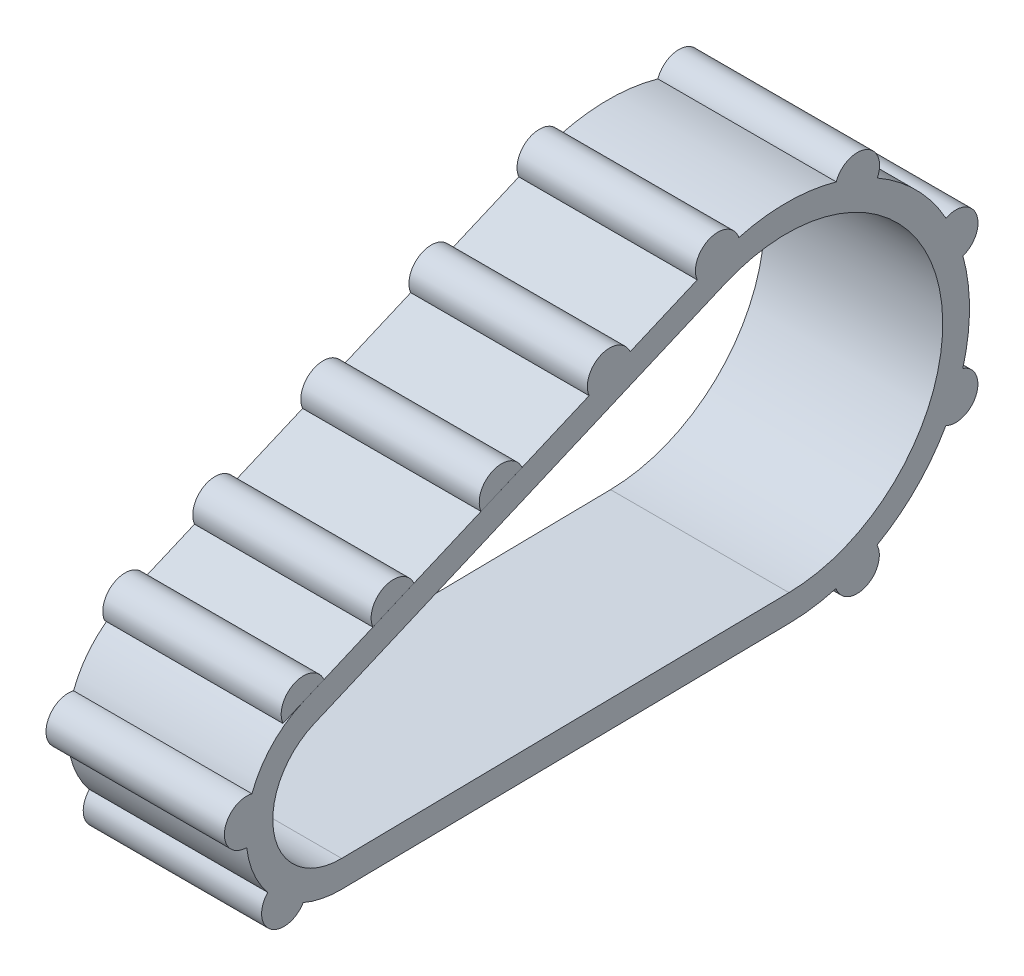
ISO-10303-21;
HEADER;
FILE_DESCRIPTION(('STEP AP214'),'2;1');
FILE_NAME('part.step','',(''),(''),'','','');
FILE_SCHEMA(('AUTOMOTIVE_DESIGN { 1 0 10303 214 1 1 1 1 }'));
ENDSEC;
DATA;
#1=APPLICATION_CONTEXT('core data for automotive mechanical design processes');
#2=APPLICATION_PROTOCOL_DEFINITION('international standard','automotive_design',2000,#1);
#3=PRODUCT_CONTEXT('',#1,'mechanical');
#4=PRODUCT('Part','Part','',(#3));
#5=PRODUCT_RELATED_PRODUCT_CATEGORY('part','',(#4));
#6=PRODUCT_DEFINITION_FORMATION('','',#4);
#7=PRODUCT_DEFINITION_CONTEXT('part definition',#1,'design');
#8=PRODUCT_DEFINITION('design','',#6,#7);
#9=PRODUCT_DEFINITION_SHAPE('','',#8);
#10=(LENGTH_UNIT() NAMED_UNIT(*) SI_UNIT(.MILLI.,.METRE.));
#11=(NAMED_UNIT(*) PLANE_ANGLE_UNIT() SI_UNIT($,.RADIAN.));
#12=(NAMED_UNIT(*) SI_UNIT($,.STERADIAN.) SOLID_ANGLE_UNIT());
#13=UNCERTAINTY_MEASURE_WITH_UNIT(LENGTH_MEASURE(1.E-05),#10,'distance_accuracy_value','');
#14=(GEOMETRIC_REPRESENTATION_CONTEXT(3) GLOBAL_UNCERTAINTY_ASSIGNED_CONTEXT((#13)) GLOBAL_UNIT_ASSIGNED_CONTEXT((#10,
#11,#12)) REPRESENTATION_CONTEXT('',''));
#15=CARTESIAN_POINT('',(0.,0.,0.));
#16=DIRECTION('',(0.,0.,1.));
#17=DIRECTION('',(1.,0.,0.));
#18=AXIS2_PLACEMENT_3D('',#15,#16,#17);
#19=CARTESIAN_POINT('',(0.,-18.1072132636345,69.3764642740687));
#20=DIRECTION('',(0.,0.919535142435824,0.393007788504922));
#21=DIRECTION('',(0.,0.393007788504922,-0.919535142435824));
#22=AXIS2_PLACEMENT_3D('',#19,#20,#21);
#23=PLANE('',#22);
#24=DIRECTION('',(0.,0.393007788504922,-0.919535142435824));
#25=VECTOR('',#24,1.);
#26=CARTESIAN_POINT('',(20.,-18.1072132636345,69.3764642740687));
#27=LINE('',#26,#25);
#28=CARTESIAN_POINT('',(20.,18.2683127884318,-15.7327256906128));
#29=VERTEX_POINT('',#28);
#30=CARTESIAN_POINT('',(20.,20.2333433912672,-20.3303818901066));
#31=VERTEX_POINT('',#30);
#32=EDGE_CURVE('E80',#29,#31,#27,.T.);
#33=ORIENTED_EDGE('',*,*,#32,.F.);
#34=DIRECTION('',(1.,0.,0.));
#35=VECTOR('',#34,1.);
#36=CARTESIAN_POINT('',(0.,18.2683127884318,-15.7327256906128));
#37=LINE('',#36,#35);
#38=CARTESIAN_POINT('',(0.,18.2683127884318,-15.7327256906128));
#39=VERTEX_POINT('',#38);
#40=EDGE_CURVE('E52',#39,#29,#37,.T.);
#41=ORIENTED_EDGE('',*,*,#40,.F.);
#42=DIRECTION('',(0.,0.393007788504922,-0.919535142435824));
#43=VECTOR('',#42,1.);
#44=CARTESIAN_POINT('',(0.,-18.1072132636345,69.3764642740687));
#45=LINE('',#44,#43);
#46=CARTESIAN_POINT('',(0.,20.2333433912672,-20.3303818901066));
#47=VERTEX_POINT('',#46);
#48=EDGE_CURVE('E79',#39,#47,#45,.T.);
#49=ORIENTED_EDGE('',*,*,#48,.T.);
#50=DIRECTION('',(1.,0.,0.));
#51=VECTOR('',#50,1.);
#52=CARTESIAN_POINT('',(0.,20.2333433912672,-20.3303818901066));
#53=LINE('',#52,#51);
#54=EDGE_CURVE('E12',#47,#31,#53,.T.);
#55=ORIENTED_EDGE('',*,*,#54,.T.);
#56=EDGE_LOOP('',(#33,#41,#49,#55));
#57=FACE_BOUND('',#56,.T.);
#58=ADVANCED_FACE('F49',(#57),#23,.F.);
#59=CARTESIAN_POINT('',(0.,19.2489160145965,-18.0323710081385));
#60=DIRECTION('',(1.,0.,0.));
#61=DIRECTION('',(0.,0.,1.));
#62=AXIS2_PLACEMENT_3D('',#59,#60,#61);
#63=CYLINDRICAL_SURFACE('',#62,2.49999025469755);
#64=CARTESIAN_POINT('',(20.,19.2489160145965,-18.0323710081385));
#65=DIRECTION('',(-1.,0.,0.));
#66=DIRECTION('',(0.,0.,1.));
#67=AXIS2_PLACEMENT_3D('',#64,#65,#66);
#68=CIRCLE('',#67,2.49999025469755);
#69=EDGE_CURVE('E72',#29,#31,#68,.T.);
#70=ORIENTED_EDGE('',*,*,#69,.T.);
#71=ORIENTED_EDGE('',*,*,#54,.F.);
#72=CARTESIAN_POINT('',(0.,19.2489160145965,-18.0323710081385));
#73=DIRECTION('',(-1.,0.,0.));
#74=DIRECTION('',(0.,0.,1.));
#75=AXIS2_PLACEMENT_3D('',#72,#73,#74);
#76=CIRCLE('',#75,2.49999025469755);
#77=EDGE_CURVE('E64',#39,#47,#76,.T.);
#78=ORIENTED_EDGE('',*,*,#77,.F.);
#79=ORIENTED_EDGE('',*,*,#40,.T.);
#80=EDGE_LOOP('',(#70,#71,#78,#79));
#81=FACE_BOUND('',#80,.T.);
#82=ADVANCED_FACE('F75',(#81),#63,.T.);
#83=CARTESIAN_POINT('',(0.,1.85458221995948,77.9081024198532));
#84=DIRECTION('',(1.,0.,0.));
#85=DIRECTION('',(0.,0.,1.));
#86=AXIS2_PLACEMENT_3D('',#83,#84,#85);
#87=PLANE('',#86);
#88=ORIENTED_EDGE('',*,*,#48,.F.);
#89=ORIENTED_EDGE('',*,*,#77,.T.);
#90=EDGE_LOOP('',(#88,#89));
#91=FACE_BOUND('',#90,.T.);
#92=ADVANCED_FACE('F88',(#91),#87,.F.);
#93=CARTESIAN_POINT('',(20.,1.85458221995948,77.9081024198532));
#94=DIRECTION('',(1.,0.,0.));
#95=DIRECTION('',(0.,0.,1.));
#96=AXIS2_PLACEMENT_3D('',#93,#94,#95);
#97=PLANE('',#96);
#98=ORIENTED_EDGE('',*,*,#32,.T.);
#99=ORIENTED_EDGE('',*,*,#69,.F.);
#100=EDGE_LOOP('',(#98,#99));
#101=FACE_BOUND('',#100,.T.);
#102=ADVANCED_FACE('F83',(#101),#97,.T.);
#103=CLOSED_SHELL('',(#58,#82,#92,#102));
#104=MANIFOLD_SOLID_BREP('B2',#103);
#105=CARTESIAN_POINT('',(0.,-18.106257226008,69.3768728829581));
#106=DIRECTION('',(0.,0.919535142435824,0.393007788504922));
#107=DIRECTION('',(0.,0.393007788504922,-0.919535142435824));
#108=AXIS2_PLACEMENT_3D('',#105,#106,#107);
#109=PLANE('',#108);
#110=DIRECTION('',(0.,0.393007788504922,-0.919535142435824));
#111=VECTOR('',#110,1.);
#112=CARTESIAN_POINT('',(20.,-18.106257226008,69.3768728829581));
#113=LINE('',#112,#111);
#114=CARTESIAN_POINT('',(20.,13.0891250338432,-3.61213931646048));
#115=VERTEX_POINT('',#114);
#116=CARTESIAN_POINT('',(20.,15.0541556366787,-8.20979551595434));
#117=VERTEX_POINT('',#116);
#118=EDGE_CURVE('E161',#115,#117,#113,.T.);
#119=ORIENTED_EDGE('',*,*,#118,.F.);
#120=DIRECTION('',(1.,0.,0.));
#121=VECTOR('',#120,1.);
#122=CARTESIAN_POINT('',(0.,13.0891250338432,-3.61213931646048));
#123=LINE('',#122,#121);
#124=CARTESIAN_POINT('',(0.,13.0891250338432,-3.61213931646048));
#125=VERTEX_POINT('',#124);
#126=EDGE_CURVE('E133',#125,#115,#123,.T.);
#127=ORIENTED_EDGE('',*,*,#126,.F.);
#128=DIRECTION('',(0.,0.393007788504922,-0.919535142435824));
#129=VECTOR('',#128,1.);
#130=CARTESIAN_POINT('',(0.,-18.106257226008,69.3768728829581));
#131=LINE('',#130,#129);
#132=CARTESIAN_POINT('',(0.,15.0541556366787,-8.20979551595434));
#133=VERTEX_POINT('',#132);
#134=EDGE_CURVE('E160',#125,#133,#131,.T.);
#135=ORIENTED_EDGE('',*,*,#134,.T.);
#136=DIRECTION('',(1.,0.,0.));
#137=VECTOR('',#136,1.);
#138=CARTESIAN_POINT('',(0.,15.0541556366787,-8.20979551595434));
#139=LINE('',#138,#137);
#140=EDGE_CURVE('E47',#133,#117,#139,.T.);
#141=ORIENTED_EDGE('',*,*,#140,.T.);
#142=EDGE_LOOP('',(#119,#127,#135,#141));
#143=FACE_BOUND('',#142,.T.);
#144=ADVANCED_FACE('F130',(#143),#109,.F.);
#145=CARTESIAN_POINT('',(0.,14.0697282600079,-5.91178463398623));
#146=DIRECTION('',(1.,0.,0.));
#147=DIRECTION('',(0.,0.,1.));
#148=AXIS2_PLACEMENT_3D('',#145,#146,#147);
#149=CYLINDRICAL_SURFACE('',#148,2.49999025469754);
#150=CARTESIAN_POINT('',(20.,14.0697282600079,-5.91178463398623));
#151=DIRECTION('',(-1.,0.,0.));
#152=DIRECTION('',(0.,0.,1.));
#153=AXIS2_PLACEMENT_3D('',#150,#151,#152);
#154=CIRCLE('',#153,2.49999025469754);
#155=EDGE_CURVE('E153',#115,#117,#154,.T.);
#156=ORIENTED_EDGE('',*,*,#155,.T.);
#157=ORIENTED_EDGE('',*,*,#140,.F.);
#158=CARTESIAN_POINT('',(0.,14.0697282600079,-5.91178463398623));
#159=DIRECTION('',(-1.,0.,0.));
#160=DIRECTION('',(0.,0.,1.));
#161=AXIS2_PLACEMENT_3D('',#158,#159,#160);
#162=CIRCLE('',#161,2.49999025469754);
#163=EDGE_CURVE('E145',#125,#133,#162,.T.);
#164=ORIENTED_EDGE('',*,*,#163,.F.);
#165=ORIENTED_EDGE('',*,*,#126,.T.);
#166=EDGE_LOOP('',(#156,#157,#164,#165));
#167=FACE_BOUND('',#166,.T.);
#168=ADVANCED_FACE('F156',(#167),#149,.T.);
#169=CARTESIAN_POINT('',(0.,1.85458221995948,77.9081024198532));
#170=DIRECTION('',(1.,0.,0.));
#171=DIRECTION('',(0.,0.,1.));
#172=AXIS2_PLACEMENT_3D('',#169,#170,#171);
#173=PLANE('',#172);
#174=ORIENTED_EDGE('',*,*,#134,.F.);
#175=ORIENTED_EDGE('',*,*,#163,.T.);
#176=EDGE_LOOP('',(#174,#175));
#177=FACE_BOUND('',#176,.T.);
#178=ADVANCED_FACE('F169',(#177),#173,.F.);
#179=CARTESIAN_POINT('',(20.,1.85458221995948,77.9081024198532));
#180=DIRECTION('',(1.,0.,0.));
#181=DIRECTION('',(0.,0.,1.));
#182=AXIS2_PLACEMENT_3D('',#179,#180,#181);
#183=PLANE('',#182);
#184=ORIENTED_EDGE('',*,*,#118,.T.);
#185=ORIENTED_EDGE('',*,*,#155,.F.);
#186=EDGE_LOOP('',(#184,#185));
#187=FACE_BOUND('',#186,.T.);
#188=ADVANCED_FACE('F164',(#187),#183,.T.);
#189=CLOSED_SHELL('',(#144,#168,#178,#188));
#190=MANIFOLD_SOLID_BREP('B6',#189);
#191=CARTESIAN_POINT('',(0.,-18.1053011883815,69.3772814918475));
#192=DIRECTION('',(0.,0.919535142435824,0.393007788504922));
#193=DIRECTION('',(0.,0.393007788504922,-0.919535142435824));
#194=AXIS2_PLACEMENT_3D('',#191,#192,#193);
#195=PLANE('',#194);
#196=DIRECTION('',(0.,0.393007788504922,-0.919535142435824));
#197=VECTOR('',#196,1.);
#198=CARTESIAN_POINT('',(20.,-18.1053011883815,69.3772814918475));
#199=LINE('',#198,#197);
#200=CARTESIAN_POINT('',(20.,8.7805089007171,6.4715378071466));
#201=VERTEX_POINT('',#200);
#202=CARTESIAN_POINT('',(20.,10.7455463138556,1.87386567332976));
#203=VERTEX_POINT('',#202);
#204=EDGE_CURVE('E241',#201,#203,#199,.T.);
#205=ORIENTED_EDGE('',*,*,#204,.F.);
#206=DIRECTION('',(1.,0.,0.));
#207=VECTOR('',#206,1.);
#208=CARTESIAN_POINT('',(0.,8.7805089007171,6.4715378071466));
#209=LINE('',#208,#207);
#210=CARTESIAN_POINT('',(0.,8.7805089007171,6.4715378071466));
#211=VERTEX_POINT('',#210);
#212=EDGE_CURVE('E213',#211,#201,#209,.T.);
#213=ORIENTED_EDGE('',*,*,#212,.F.);
#214=DIRECTION('',(0.,0.393007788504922,-0.919535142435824));
#215=VECTOR('',#214,1.);
#216=CARTESIAN_POINT('',(0.,-18.1053011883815,69.3772814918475));
#217=LINE('',#216,#215);
#218=CARTESIAN_POINT('',(0.,10.7455463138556,1.87386567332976));
#219=VERTEX_POINT('',#218);
#220=EDGE_CURVE('E240',#211,#219,#217,.T.);
#221=ORIENTED_EDGE('',*,*,#220,.T.);
#222=DIRECTION('',(1.,0.,0.));
#223=VECTOR('',#222,1.);
#224=CARTESIAN_POINT('',(0.,10.7455463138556,1.87386567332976));
#225=LINE('',#224,#223);
#226=EDGE_CURVE('E128',#219,#203,#225,.T.);
#227=ORIENTED_EDGE('',*,*,#226,.T.);
#228=EDGE_LOOP('',(#205,#213,#221,#227));
#229=FACE_BOUND('',#228,.T.);
#230=ADVANCED_FACE('F210',(#229),#195,.F.);
#231=CARTESIAN_POINT('',(0.,9.76015949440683,4.17147591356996));
#232=DIRECTION('',(1.,0.,0.));
#233=DIRECTION('',(0.,0.,1.));
#234=AXIS2_PLACEMENT_3D('',#231,#232,#233);
#235=CYLINDRICAL_SURFACE('',#234,2.5);
#236=CARTESIAN_POINT('',(20.,9.76015949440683,4.17147591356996));
#237=DIRECTION('',(-1.,0.,0.));
#238=DIRECTION('',(0.,0.,1.));
#239=AXIS2_PLACEMENT_3D('',#236,#237,#238);
#240=CIRCLE('',#239,2.5);
#241=EDGE_CURVE('E233',#201,#203,#240,.T.);
#242=ORIENTED_EDGE('',*,*,#241,.T.);
#243=ORIENTED_EDGE('',*,*,#226,.F.);
#244=CARTESIAN_POINT('',(0.,9.76015949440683,4.17147591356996));
#245=DIRECTION('',(-1.,0.,0.));
#246=DIRECTION('',(0.,0.,1.));
#247=AXIS2_PLACEMENT_3D('',#244,#245,#246);
#248=CIRCLE('',#247,2.5);
#249=EDGE_CURVE('E225',#211,#219,#248,.T.);
#250=ORIENTED_EDGE('',*,*,#249,.F.);
#251=ORIENTED_EDGE('',*,*,#212,.T.);
#252=EDGE_LOOP('',(#242,#243,#250,#251));
#253=FACE_BOUND('',#252,.T.);
#254=ADVANCED_FACE('F236',(#253),#235,.T.);
#255=CARTESIAN_POINT('',(0.,1.85458221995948,77.9081024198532));
#256=DIRECTION('',(1.,0.,0.));
#257=DIRECTION('',(0.,0.,1.));
#258=AXIS2_PLACEMENT_3D('',#255,#256,#257);
#259=PLANE('',#258);
#260=ORIENTED_EDGE('',*,*,#220,.F.);
#261=ORIENTED_EDGE('',*,*,#249,.T.);
#262=EDGE_LOOP('',(#260,#261));
#263=FACE_BOUND('',#262,.T.);
#264=ADVANCED_FACE('F249',(#263),#259,.F.);
#265=CARTESIAN_POINT('',(20.,1.85458221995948,77.9081024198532));
#266=DIRECTION('',(1.,0.,0.));
#267=DIRECTION('',(0.,0.,1.));
#268=AXIS2_PLACEMENT_3D('',#265,#266,#267);
#269=PLANE('',#268);
#270=ORIENTED_EDGE('',*,*,#204,.T.);
#271=ORIENTED_EDGE('',*,*,#241,.F.);
#272=EDGE_LOOP('',(#270,#271));
#273=FACE_BOUND('',#272,.T.);
#274=ADVANCED_FACE('F244',(#273),#269,.T.);
#275=CLOSED_SHELL('',(#230,#254,#264,#274));
#276=MANIFOLD_SOLID_BREP('B41',#275);
#277=CARTESIAN_POINT('',(20.,10.6190847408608,-50.));
#278=DIRECTION('',(-1.,0.,0.));
#279=DIRECTION('',(0.,0.,-1.));
#280=AXIS2_PLACEMENT_3D('',#277,#278,#279);
#281=CYLINDRICAL_SURFACE('',#280,20.5);
#282=CARTESIAN_POINT('',(0.,10.6190847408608,-50.));
#283=DIRECTION('',(-1.,0.,0.));
#284=DIRECTION('',(0.,0.,1.));
#285=AXIS2_PLACEMENT_3D('',#282,#283,#284);
#286=CIRCLE('',#285,20.5);
#287=CARTESIAN_POINT('',(0.,16.0630573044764,-69.7639359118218));
#288=VERTEX_POINT('',#287);
#289=CARTESIAN_POINT('',(0.,5.14359703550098,-69.755228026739));
#290=VERTEX_POINT('',#289);
#291=EDGE_CURVE('E452',#288,#290,#286,.T.);
#292=ORIENTED_EDGE('',*,*,#291,.F.);
#293=DIRECTION('',(1.,0.,0.));
#294=VECTOR('',#293,1.);
#295=CARTESIAN_POINT('',(0.,16.0630573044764,-69.7639359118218));
#296=LINE('',#295,#294);
#297=CARTESIAN_POINT('',(20.,16.0630573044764,-69.7639359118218));
#298=VERTEX_POINT('',#297);
#299=EDGE_CURVE('E498',#288,#298,#296,.T.);
#300=ORIENTED_EDGE('',*,*,#299,.T.);
#301=CARTESIAN_POINT('',(20.,10.6190847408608,-50.));
#302=DIRECTION('',(-1.,0.,0.));
#303=DIRECTION('',(0.,0.,1.));
#304=AXIS2_PLACEMENT_3D('',#301,#302,#303);
#305=CIRCLE('',#304,20.5);
#306=CARTESIAN_POINT('',(20.,5.14359703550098,-69.755228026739));
#307=VERTEX_POINT('',#306);
#308=EDGE_CURVE('E597',#298,#307,#305,.T.);
#309=ORIENTED_EDGE('',*,*,#308,.T.);
#310=DIRECTION('',(1.,0.,0.));
#311=VECTOR('',#310,1.);
#312=CARTESIAN_POINT('',(0.,5.14359703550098,-69.755228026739));
#313=LINE('',#312,#311);
#314=EDGE_CURVE('E454',#290,#307,#313,.T.);
#315=ORIENTED_EDGE('',*,*,#314,.F.);
#316=EDGE_LOOP('',(#292,#300,#309,#315));
#317=FACE_BOUND('',#316,.T.);
#318=ADVANCED_FACE('F281',(#317),#281,.T.);
#319=CARTESIAN_POINT('',(20.,0.532253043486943,-67.8467315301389));
#320=VERTEX_POINT('',#319);
#321=CARTESIAN_POINT('',(20.,-7.19965411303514,-60.1361997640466));
#322=VERTEX_POINT('',#321);
#323=EDGE_CURVE('E556',#320,#322,#305,.T.);
#324=ORIENTED_EDGE('',*,*,#323,.T.);
#325=DIRECTION('',(1.,0.,0.));
#326=VECTOR('',#325,1.);
#327=CARTESIAN_POINT('',(0.,-7.19965411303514,-60.1361997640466));
#328=LINE('',#327,#326);
#329=CARTESIAN_POINT('',(0.,-7.19965411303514,-60.1361997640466));
#330=VERTEX_POINT('',#329);
#331=EDGE_CURVE('E464',#330,#322,#328,.T.);
#332=ORIENTED_EDGE('',*,*,#331,.F.);
#333=CARTESIAN_POINT('',(0.,0.532253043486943,-67.8467315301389));
#334=VERTEX_POINT('',#333);
#335=EDGE_CURVE('E449',#334,#330,#286,.T.);
#336=ORIENTED_EDGE('',*,*,#335,.F.);
#337=DIRECTION('',(1.,0.,0.));
#338=VECTOR('',#337,1.);
#339=CARTESIAN_POINT('',(0.,0.532253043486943,-67.8467315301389));
#340=LINE('',#339,#338);
#341=EDGE_CURVE('E456',#334,#320,#340,.T.);
#342=ORIENTED_EDGE('',*,*,#341,.T.);
#343=EDGE_LOOP('',(#324,#332,#336,#342));
#344=FACE_BOUND('',#343,.T.);
#345=ADVANCED_FACE('F462',(#344),#281,.T.);
#346=CARTESIAN_POINT('',(20.,0.,0.));
#347=DIRECTION('',(-1.,0.,0.));
#348=DIRECTION('',(0.,0.,-1.));
#349=AXIS2_PLACEMENT_3D('',#346,#347,#348);
#350=CYLINDRICAL_SURFACE('',#349,10.6142321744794);
#351=CARTESIAN_POINT('',(0.,0.,0.));
#352=DIRECTION('',(-1.,0.,0.));
#353=DIRECTION('',(0.,0.,1.));
#354=AXIS2_PLACEMENT_3D('',#351,#352,#353);
#355=CIRCLE('',#354,10.6142321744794);
#356=CARTESIAN_POINT('',(0.,-10.6130940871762,-0.155430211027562));
#357=VERTEX_POINT('',#356);
#358=CARTESIAN_POINT('',(0.,-9.74627210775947,4.20382024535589));
#359=VERTEX_POINT('',#358);
#360=EDGE_CURVE('E540',#357,#359,#355,.T.);
#361=ORIENTED_EDGE('',*,*,#360,.F.);
#362=DIRECTION('',(-1.,0.,0.));
#363=VECTOR('',#362,1.);
#364=CARTESIAN_POINT('',(20.,-10.6130940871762,-0.155430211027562));
#365=LINE('',#364,#363);
#366=CARTESIAN_POINT('',(20.,-10.6130940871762,-0.155430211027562));
#367=VERTEX_POINT('',#366);
#368=EDGE_CURVE('E291',#367,#357,#365,.T.);
#369=ORIENTED_EDGE('',*,*,#368,.F.);
#370=CARTESIAN_POINT('',(20.,0.,0.));
#371=DIRECTION('',(-1.,0.,0.));
#372=DIRECTION('',(0.,0.,1.));
#373=AXIS2_PLACEMENT_3D('',#370,#371,#372);
#374=CIRCLE('',#373,10.6142321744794);
#375=CARTESIAN_POINT('',(20.,-9.74627210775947,4.20382024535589));
#376=VERTEX_POINT('',#375);
#377=EDGE_CURVE('E560',#367,#376,#374,.T.);
#378=ORIENTED_EDGE('',*,*,#377,.T.);
#379=DIRECTION('',(1.,0.,0.));
#380=VECTOR('',#379,1.);
#381=CARTESIAN_POINT('',(0.,-9.74627210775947,4.20382024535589));
#382=LINE('',#381,#380);
#383=EDGE_CURVE('E629',#359,#376,#382,.T.);
#384=ORIENTED_EDGE('',*,*,#383,.F.);
#385=EDGE_LOOP('',(#361,#369,#378,#384));
#386=FACE_BOUND('',#385,.T.);
#387=ADVANCED_FACE('F654',(#386),#350,.T.);
#388=CARTESIAN_POINT('',(20.,-6.76795796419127,8.17659278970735));
#389=VERTEX_POINT('',#388);
#390=CARTESIAN_POINT('',(20.,-1.23252092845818,10.5424293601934));
#391=VERTEX_POINT('',#390);
#392=EDGE_CURVE('E564',#389,#391,#374,.T.);
#393=ORIENTED_EDGE('',*,*,#392,.T.);
#394=DIRECTION('',(1.,0.,0.));
#395=VECTOR('',#394,1.);
#396=CARTESIAN_POINT('',(0.,-1.23252092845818,10.5424293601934));
#397=LINE('',#396,#395);
#398=CARTESIAN_POINT('',(0.,-1.23252092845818,10.5424293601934));
#399=VERTEX_POINT('',#398);
#400=EDGE_CURVE('E640',#399,#391,#397,.T.);
#401=ORIENTED_EDGE('',*,*,#400,.F.);
#402=CARTESIAN_POINT('',(0.,-6.76795796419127,8.17659278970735));
#403=VERTEX_POINT('',#402);
#404=EDGE_CURVE('E947',#403,#399,#355,.T.);
#405=ORIENTED_EDGE('',*,*,#404,.F.);
#406=DIRECTION('',(1.,0.,0.));
#407=VECTOR('',#406,1.);
#408=CARTESIAN_POINT('',(0.,-6.76795796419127,8.17659278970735));
#409=LINE('',#408,#407);
#410=EDGE_CURVE('E631',#403,#389,#409,.T.);
#411=ORIENTED_EDGE('',*,*,#410,.T.);
#412=EDGE_LOOP('',(#393,#401,#405,#411));
#413=FACE_BOUND('',#412,.T.);
#414=ADVANCED_FACE('F669',(#413),#350,.T.);
#415=CARTESIAN_POINT('',(0.,28.4216344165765,-60.1646064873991));
#416=VERTEX_POINT('',#415);
#417=CARTESIAN_POINT('',(0.,20.6774393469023,-67.8627966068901));
#418=VERTEX_POINT('',#417);
#419=EDGE_CURVE('E468',#416,#418,#286,.T.);
#420=ORIENTED_EDGE('',*,*,#419,.F.);
#421=DIRECTION('',(1.,0.,0.));
#422=VECTOR('',#421,1.);
#423=CARTESIAN_POINT('',(0.,28.4216344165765,-60.1646064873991));
#424=LINE('',#423,#422);
#425=CARTESIAN_POINT('',(20.,28.4216344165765,-60.1646064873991));
#426=VERTEX_POINT('',#425);
#427=EDGE_CURVE('E492',#416,#426,#424,.T.);
#428=ORIENTED_EDGE('',*,*,#427,.T.);
#429=CARTESIAN_POINT('',(20.,20.6774393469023,-67.8627966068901));
#430=VERTEX_POINT('',#429);
#431=EDGE_CURVE('E496',#426,#430,#305,.T.);
#432=ORIENTED_EDGE('',*,*,#431,.T.);
#433=DIRECTION('',(1.,0.,0.));
#434=VECTOR('',#433,1.);
#435=CARTESIAN_POINT('',(0.,20.6774393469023,-67.8627966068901));
#436=LINE('',#435,#434);
#437=EDGE_CURVE('E494',#418,#430,#436,.T.);
#438=ORIENTED_EDGE('',*,*,#437,.F.);
#439=EDGE_LOOP('',(#420,#428,#432,#438));
#440=FACE_BOUND('',#439,.T.);
#441=ADVANCED_FACE('F490',(#440),#281,.T.);
#442=CARTESIAN_POINT('',(0.,30.4065862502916,-44.6423154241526));
#443=VERTEX_POINT('',#442);
#444=CARTESIAN_POINT('',(0.,30.3502334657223,-55.5616337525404));
#445=VERTEX_POINT('',#444);
#446=EDGE_CURVE('E467',#443,#445,#286,.T.);
#447=ORIENTED_EDGE('',*,*,#446,.F.);
#448=DIRECTION('',(1.,0.,0.));
#449=VECTOR('',#448,1.);
#450=CARTESIAN_POINT('',(0.,30.4065862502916,-44.6423154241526));
#451=LINE('',#450,#449);
#452=CARTESIAN_POINT('',(20.,30.4065862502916,-44.6423154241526));
#453=VERTEX_POINT('',#452);
#454=EDGE_CURVE('E518',#443,#453,#451,.T.);
#455=ORIENTED_EDGE('',*,*,#454,.T.);
#456=CARTESIAN_POINT('',(20.,30.3502334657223,-55.5616337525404));
#457=VERTEX_POINT('',#456);
#458=EDGE_CURVE('E552',#453,#457,#305,.T.);
#459=ORIENTED_EDGE('',*,*,#458,.T.);
#460=DIRECTION('',(1.,0.,0.));
#461=VECTOR('',#460,1.);
#462=CARTESIAN_POINT('',(0.,30.3502334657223,-55.5616337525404));
#463=LINE('',#462,#461);
#464=EDGE_CURVE('E508',#445,#457,#463,.T.);
#465=ORIENTED_EDGE('',*,*,#464,.F.);
#466=EDGE_LOOP('',(#447,#455,#459,#465));
#467=FACE_BOUND('',#466,.T.);
#468=ADVANCED_FACE('F592',(#467),#281,.T.);
#469=CARTESIAN_POINT('',(20.,-4.09956865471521,36.5996044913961));
#470=DIRECTION('',(0.,-0.919535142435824,-0.393007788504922));
#471=DIRECTION('',(0.,-0.393007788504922,0.919535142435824));
#472=AXIS2_PLACEMENT_3D('',#469,#470,#471);
#473=PLANE('',#472);
#474=DIRECTION('',(0.,0.393007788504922,-0.919535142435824));
#475=VECTOR('',#474,1.);
#476=CARTESIAN_POINT('',(0.,-4.09956865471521,36.5996044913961));
#477=LINE('',#476,#475);
#478=CARTESIAN_POINT('',(0.,9.76015949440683,4.17147591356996));
#479=VERTEX_POINT('',#478);
#480=CARTESIAN_POINT('',(0.,23.4475005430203,-27.8533120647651));
#481=VERTEX_POINT('',#480);
#482=EDGE_CURVE('E470',#479,#481,#477,.T.);
#483=ORIENTED_EDGE('',*,*,#482,.F.);
#484=DIRECTION('',(-1.,0.,0.));
#485=VECTOR('',#484,1.);
#486=CARTESIAN_POINT('',(20.,9.76015949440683,4.17147591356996));
#487=LINE('',#486,#485);
#488=CARTESIAN_POINT('',(20.,9.76015949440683,4.17147591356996));
#489=VERTEX_POINT('',#488);
#490=EDGE_CURVE('E698',#489,#479,#487,.T.);
#491=ORIENTED_EDGE('',*,*,#490,.F.);
#492=DIRECTION('',(0.,0.393007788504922,-0.919535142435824));
#493=VECTOR('',#492,1.);
#494=CARTESIAN_POINT('',(20.,-4.09956865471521,36.5996044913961));
#495=LINE('',#494,#493);
#496=CARTESIAN_POINT('',(20.,23.4475005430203,-27.8533120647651));
#497=VERTEX_POINT('',#496);
#498=EDGE_CURVE('E548',#489,#497,#495,.T.);
#499=ORIENTED_EDGE('',*,*,#498,.T.);
#500=DIRECTION('',(1.,0.,0.));
#501=VECTOR('',#500,1.);
#502=CARTESIAN_POINT('',(0.,23.4475005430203,-27.8533120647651));
#503=LINE('',#502,#501);
#504=EDGE_CURVE('E527',#481,#497,#503,.T.);
#505=ORIENTED_EDGE('',*,*,#504,.F.);
#506=EDGE_LOOP('',(#483,#491,#499,#505));
#507=FACE_BOUND('',#506,.T.);
#508=ADVANCED_FACE('F662',(#507),#473,.F.);
#509=CARTESIAN_POINT('',(0.,25.4125311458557,-32.4509682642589));
#510=VERTEX_POINT('',#509);
#511=CARTESIAN_POINT('',(0.,28.6276447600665,-39.9734908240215));
#512=VERTEX_POINT('',#511);
#513=EDGE_CURVE('E575',#510,#512,#477,.T.);
#514=ORIENTED_EDGE('',*,*,#513,.F.);
#515=DIRECTION('',(1.,0.,0.));
#516=VECTOR('',#515,1.);
#517=CARTESIAN_POINT('',(0.,25.4125311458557,-32.4509682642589));
#518=LINE('',#517,#516);
#519=CARTESIAN_POINT('',(20.,25.4125311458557,-32.4509682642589));
#520=VERTEX_POINT('',#519);
#521=EDGE_CURVE('E530',#510,#520,#518,.T.);
#522=ORIENTED_EDGE('',*,*,#521,.T.);
#523=CARTESIAN_POINT('',(20.,28.6276447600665,-39.9734908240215));
#524=VERTEX_POINT('',#523);
#525=EDGE_CURVE('E547',#520,#524,#495,.T.);
#526=ORIENTED_EDGE('',*,*,#525,.T.);
#527=DIRECTION('',(1.,0.,0.));
#528=VECTOR('',#527,1.);
#529=CARTESIAN_POINT('',(0.,28.6276447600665,-39.9734908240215));
#530=LINE('',#529,#528);
#531=EDGE_CURVE('E516',#512,#524,#530,.T.);
#532=ORIENTED_EDGE('',*,*,#531,.F.);
#533=EDGE_LOOP('',(#514,#522,#526,#532));
#534=FACE_BOUND('',#533,.T.);
#535=ADVANCED_FACE('F584',(#534),#473,.F.);
#536=CARTESIAN_POINT('',(20.,-9.12090929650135,-55.5301569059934));
#537=VERTEX_POINT('',#536);
#538=CARTESIAN_POINT('',(20.,-9.87871719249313,-50.3001931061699));
#539=VERTEX_POINT('',#538);
#540=EDGE_CURVE('E551',#537,#539,#305,.T.);
#541=ORIENTED_EDGE('',*,*,#540,.T.);
#542=DIRECTION('',(-1.,0.,0.));
#543=VECTOR('',#542,1.);
#544=CARTESIAN_POINT('',(20.,-9.87871719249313,-50.3001931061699));
#545=LINE('',#544,#543);
#546=CARTESIAN_POINT('',(0.,-9.87871719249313,-50.3001931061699));
#547=VERTEX_POINT('',#546);
#548=EDGE_CURVE('E208',#539,#547,#545,.T.);
#549=ORIENTED_EDGE('',*,*,#548,.T.);
#550=CARTESIAN_POINT('',(0.,-9.12090929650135,-55.5301569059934));
#551=VERTEX_POINT('',#550);
#552=EDGE_CURVE('E465',#551,#547,#286,.T.);
#553=ORIENTED_EDGE('',*,*,#552,.F.);
#554=DIRECTION('',(1.,0.,0.));
#555=VECTOR('',#554,1.);
#556=CARTESIAN_POINT('',(0.,-9.12090929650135,-55.5301569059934));
#557=LINE('',#556,#555);
#558=EDGE_CURVE('E609',#551,#537,#557,.T.);
#559=ORIENTED_EDGE('',*,*,#558,.T.);
#560=EDGE_LOOP('',(#541,#549,#553,#559));
#561=FACE_BOUND('',#560,.T.);
#562=ADVANCED_FACE('F605',(#561),#281,.T.);
#563=CARTESIAN_POINT('',(20.,-11.232768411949,42.1572055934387));
#564=DIRECTION('',(0.,0.999892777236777,0.0146435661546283));
#565=DIRECTION('',(0.,0.0146435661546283,-0.999892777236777));
#566=AXIS2_PLACEMENT_3D('',#563,#564,#565);
#567=PLANE('',#566);
#568=DIRECTION('',(0.,-0.0146435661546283,0.999892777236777));
#569=VECTOR('',#568,1.);
#570=CARTESIAN_POINT('',(0.,-11.232768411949,42.1572055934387));
#571=LINE('',#570,#569);
#572=EDGE_CURVE('E475',#547,#357,#571,.T.);
#573=ORIENTED_EDGE('',*,*,#572,.F.);
#574=ORIENTED_EDGE('',*,*,#548,.F.);
#575=DIRECTION('',(0.,-0.0146435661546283,0.999892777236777));
#576=VECTOR('',#575,1.);
#577=CARTESIAN_POINT('',(20.,-11.232768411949,42.1572055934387));
#578=LINE('',#577,#576);
#579=EDGE_CURVE('E555',#539,#367,#578,.T.);
#580=ORIENTED_EDGE('',*,*,#579,.T.);
#581=ORIENTED_EDGE('',*,*,#368,.T.);
#582=EDGE_LOOP('',(#573,#574,#580,#581));
#583=FACE_BOUND('',#582,.T.);
#584=ADVANCED_FACE('F614',(#583),#567,.F.);
#585=CARTESIAN_POINT('',(20.,0.,0.));
#586=DIRECTION('',(-1.,0.,0.));
#587=DIRECTION('',(0.,0.,-1.));
#588=AXIS2_PLACEMENT_3D('',#585,#586,#587);
#589=CYLINDRICAL_SURFACE('',#588,7.61423217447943);
#590=CARTESIAN_POINT('',(0.,0.,0.));
#591=DIRECTION('',(-1.,0.,0.));
#592=DIRECTION('',(0.,0.,1.));
#593=AXIS2_PLACEMENT_3D('',#590,#591,#592);
#594=CIRCLE('',#593,7.61423217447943);
#595=CARTESIAN_POINT('',(0.,-7.61341575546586,-0.11149951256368));
#596=VERTEX_POINT('',#595);
#597=CARTESIAN_POINT('',(0.,7.00155406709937,2.99245254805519));
#598=VERTEX_POINT('',#597);
#599=EDGE_CURVE('E533',#596,#598,#594,.T.);
#600=ORIENTED_EDGE('',*,*,#599,.T.);
#601=DIRECTION('',(-1.,0.,0.));
#602=VECTOR('',#601,1.);
#603=CARTESIAN_POINT('',(20.,7.00155406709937,2.99245254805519));
#604=LINE('',#603,#602);
#605=CARTESIAN_POINT('',(20.,7.00155406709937,2.99245254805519));
#606=VERTEX_POINT('',#605);
#607=EDGE_CURVE('E563',#606,#598,#604,.T.);
#608=ORIENTED_EDGE('',*,*,#607,.F.);
#609=CARTESIAN_POINT('',(20.,0.,0.));
#610=DIRECTION('',(-1.,0.,0.));
#611=DIRECTION('',(0.,0.,1.));
#612=AXIS2_PLACEMENT_3D('',#609,#610,#611);
#613=CIRCLE('',#612,7.61423217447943);
#614=CARTESIAN_POINT('',(20.,-7.61341575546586,-0.11149951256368));
#615=VERTEX_POINT('',#614);
#616=EDGE_CURVE('E536',#615,#606,#613,.T.);
#617=ORIENTED_EDGE('',*,*,#616,.F.);
#618=DIRECTION('',(-1.,0.,0.));
#619=VECTOR('',#618,1.);
#620=CARTESIAN_POINT('',(20.,-7.61341575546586,-0.11149951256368));
#621=LINE('',#620,#619);
#622=EDGE_CURVE('E285',#615,#596,#621,.T.);
#623=ORIENTED_EDGE('',*,*,#622,.T.);
#624=EDGE_LOOP('',(#600,#608,#617,#623));
#625=FACE_BOUND('',#624,.T.);
#626=ADVANCED_FACE('F283',(#625),#589,.F.);
#627=CARTESIAN_POINT('',(20.,-8.23309008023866,42.2011362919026));
#628=DIRECTION('',(0.,0.999892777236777,0.0146435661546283));
#629=DIRECTION('',(0.,0.0146435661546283,-0.999892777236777));
#630=AXIS2_PLACEMENT_3D('',#627,#628,#629);
#631=PLANE('',#630);
#632=DIRECTION('',(0.,-0.0146435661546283,0.999892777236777));
#633=VECTOR('',#632,1.);
#634=CARTESIAN_POINT('',(0.,-8.23309008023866,42.2011362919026));
#635=LINE('',#634,#633);
#636=CARTESIAN_POINT('',(0.,-6.8790388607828,-50.256262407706));
#637=VERTEX_POINT('',#636);
#638=EDGE_CURVE('E568',#637,#596,#635,.T.);
#639=ORIENTED_EDGE('',*,*,#638,.T.);
#640=ORIENTED_EDGE('',*,*,#622,.F.);
#641=DIRECTION('',(0.,-0.0146435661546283,0.999892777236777));
#642=VECTOR('',#641,1.);
#643=CARTESIAN_POINT('',(20.,-8.23309008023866,42.2011362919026));
#644=LINE('',#643,#642);
#645=CARTESIAN_POINT('',(20.,-6.8790388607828,-50.256262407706));
#646=VERTEX_POINT('',#645);
#647=EDGE_CURVE('E539',#646,#615,#644,.T.);
#648=ORIENTED_EDGE('',*,*,#647,.F.);
#649=DIRECTION('',(-1.,0.,0.));
#650=VECTOR('',#649,1.);
#651=CARTESIAN_POINT('',(20.,-6.8790388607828,-50.256262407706));
#652=LINE('',#651,#650);
#653=EDGE_CURVE('E706',#646,#637,#652,.T.);
#654=ORIENTED_EDGE('',*,*,#653,.T.);
#655=EDGE_LOOP('',(#639,#640,#648,#654));
#656=FACE_BOUND('',#655,.T.);
#657=ADVANCED_FACE('F718',(#656),#631,.T.);
#658=CARTESIAN_POINT('',(20.,10.6190847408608,-50.));
#659=DIRECTION('',(-1.,0.,0.));
#660=DIRECTION('',(0.,0.,-1.));
#661=AXIS2_PLACEMENT_3D('',#658,#659,#660);
#662=CYLINDRICAL_SURFACE('',#661,17.5);
#663=CARTESIAN_POINT('',(0.,10.6190847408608,-50.));
#664=DIRECTION('',(-1.,0.,0.));
#665=DIRECTION('',(0.,0.,1.));
#666=AXIS2_PLACEMENT_3D('',#663,#664,#665);
#667=CIRCLE('',#666,17.5);
#668=CARTESIAN_POINT('',(0.,26.7109497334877,-43.1223637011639));
#669=VERTEX_POINT('',#668);
#670=EDGE_CURVE('E571',#669,#637,#667,.T.);
#671=ORIENTED_EDGE('',*,*,#670,.T.);
#672=ORIENTED_EDGE('',*,*,#653,.F.);
#673=CARTESIAN_POINT('',(20.,10.6190847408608,-50.));
#674=DIRECTION('',(-1.,0.,0.));
#675=DIRECTION('',(0.,0.,1.));
#676=AXIS2_PLACEMENT_3D('',#673,#674,#675);
#677=CIRCLE('',#676,17.5);
#678=CARTESIAN_POINT('',(20.,26.7109497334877,-43.1223637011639));
#679=VERTEX_POINT('',#678);
#680=EDGE_CURVE('E542',#679,#646,#677,.T.);
#681=ORIENTED_EDGE('',*,*,#680,.F.);
#682=DIRECTION('',(-1.,0.,0.));
#683=VECTOR('',#682,1.);
#684=CARTESIAN_POINT('',(20.,26.7109497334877,-43.1223637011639));
#685=LINE('',#684,#683);
#686=EDGE_CURVE('E711',#679,#669,#685,.T.);
#687=ORIENTED_EDGE('',*,*,#686,.T.);
#688=EDGE_LOOP('',(#671,#672,#681,#687));
#689=FACE_BOUND('',#688,.T.);
#690=ADVANCED_FACE('F691',(#689),#662,.F.);
#691=CARTESIAN_POINT('',(20.,-6.85817408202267,35.4205811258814));
#692=DIRECTION('',(0.,-0.919535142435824,-0.393007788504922));
#693=DIRECTION('',(0.,-0.393007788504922,0.919535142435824));
#694=AXIS2_PLACEMENT_3D('',#691,#692,#693);
#695=PLANE('',#694);
#696=DIRECTION('',(0.,0.393007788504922,-0.919535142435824));
#697=VECTOR('',#696,1.);
#698=CARTESIAN_POINT('',(0.,-6.85817408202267,35.4205811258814));
#699=LINE('',#698,#697);
#700=EDGE_CURVE('E574',#598,#669,#699,.T.);
#701=ORIENTED_EDGE('',*,*,#700,.T.);
#702=ORIENTED_EDGE('',*,*,#686,.F.);
#703=DIRECTION('',(0.,0.393007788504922,-0.919535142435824));
#704=VECTOR('',#703,1.);
#705=CARTESIAN_POINT('',(20.,-6.85817408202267,35.4205811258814));
#706=LINE('',#705,#704);
#707=EDGE_CURVE('E544',#606,#679,#706,.T.);
#708=ORIENTED_EDGE('',*,*,#707,.F.);
#709=ORIENTED_EDGE('',*,*,#607,.T.);
#710=EDGE_LOOP('',(#701,#702,#708,#709));
#711=FACE_BOUND('',#710,.T.);
#712=ADVANCED_FACE('F683',(#711),#695,.T.);
#713=CARTESIAN_POINT('',(20.,3.69715809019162,9.94951992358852));
#714=VERTEX_POINT('',#713);
#715=EDGE_CURVE('E559',#714,#489,#374,.T.);
#716=ORIENTED_EDGE('',*,*,#715,.T.);
#717=ORIENTED_EDGE('',*,*,#490,.T.);
#718=CARTESIAN_POINT('',(0.,3.69715809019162,9.94951992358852));
#719=VERTEX_POINT('',#718);
#720=EDGE_CURVE('E480',#719,#479,#355,.T.);
#721=ORIENTED_EDGE('',*,*,#720,.F.);
#722=DIRECTION('',(1.,0.,0.));
#723=VECTOR('',#722,1.);
#724=CARTESIAN_POINT('',(0.,3.69715809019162,9.94951992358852));
#725=LINE('',#724,#723);
#726=EDGE_CURVE('E642',#719,#714,#725,.T.);
#727=ORIENTED_EDGE('',*,*,#726,.T.);
#728=EDGE_LOOP('',(#716,#717,#721,#727));
#729=FACE_BOUND('',#728,.T.);
#730=ADVANCED_FACE('F675',(#729),#350,.T.);
#731=CARTESIAN_POINT('',(20.,9.61823610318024,42.462571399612));
#732=DIRECTION('',(1.,0.,0.));
#733=DIRECTION('',(0.,0.,1.));
#734=AXIS2_PLACEMENT_3D('',#731,#732,#733);
#735=PLANE('',#734);
#736=ORIENTED_EDGE('',*,*,#616,.T.);
#737=ORIENTED_EDGE('',*,*,#707,.T.);
#738=ORIENTED_EDGE('',*,*,#680,.T.);
#739=ORIENTED_EDGE('',*,*,#647,.T.);
#740=EDGE_LOOP('',(#736,#737,#738,#739));
#741=FACE_BOUND('',#740,.T.);
#742=ORIENTED_EDGE('',*,*,#498,.F.);
#743=ORIENTED_EDGE('',*,*,#715,.F.);
#744=CARTESIAN_POINT('',(20.,1.26747563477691,10.5382840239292));
#745=DIRECTION('',(-1.,0.,0.));
#746=DIRECTION('',(0.,0.,1.));
#747=AXIS2_PLACEMENT_3D('',#744,#745,#746);
#748=CIRCLE('',#747,2.5);
#749=EDGE_CURVE('E634',#391,#714,#748,.T.);
#750=ORIENTED_EDGE('',*,*,#749,.F.);
#751=ORIENTED_EDGE('',*,*,#392,.F.);
#752=CARTESIAN_POINT('',(20.,-8.49268385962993,6.36680811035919));
#753=DIRECTION('',(-1.,0.,0.));
#754=DIRECTION('',(0.,0.,1.));
#755=AXIS2_PLACEMENT_3D('',#752,#753,#754);
#756=CIRCLE('',#755,2.5);
#757=EDGE_CURVE('E621',#376,#389,#756,.T.);
#758=ORIENTED_EDGE('',*,*,#757,.F.);
#759=ORIENTED_EDGE('',*,*,#377,.F.);
#760=ORIENTED_EDGE('',*,*,#579,.F.);
#761=ORIENTED_EDGE('',*,*,#540,.F.);
#762=CARTESIAN_POINT('',(20.,-8.30097383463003,-57.891863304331));
#763=DIRECTION('',(-1.,0.,0.));
#764=DIRECTION('',(0.,0.,1.));
#765=AXIS2_PLACEMENT_3D('',#762,#763,#764);
#766=CIRCLE('',#765,2.49999025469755);
#767=EDGE_CURVE('E460',#322,#537,#766,.T.);
#768=ORIENTED_EDGE('',*,*,#767,.F.);
#769=ORIENTED_EDGE('',*,*,#323,.F.);
#770=CARTESIAN_POINT('',(20.,2.77962978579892,-68.9418338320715));
#771=DIRECTION('',(-1.,0.,0.));
#772=DIRECTION('',(0.,0.,1.));
#773=AXIS2_PLACEMENT_3D('',#770,#771,#772);
#774=CIRCLE('',#773,2.49999025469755);
#775=EDGE_CURVE('E299',#307,#320,#774,.T.);
#776=ORIENTED_EDGE('',*,*,#775,.F.);
#777=ORIENTED_EDGE('',*,*,#308,.F.);
#778=CARTESIAN_POINT('',(20.,18.4283188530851,-68.9543131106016));
#779=DIRECTION('',(-1.,0.,0.));
#780=DIRECTION('',(0.,0.,1.));
#781=AXIS2_PLACEMENT_3D('',#778,#779,#780);
#782=CIRCLE('',#781,2.49999025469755);
#783=EDGE_CURVE('E503',#430,#298,#782,.T.);
#784=ORIENTED_EDGE('',*,*,#783,.F.);
#785=ORIENTED_EDGE('',*,*,#431,.F.);
#786=CARTESIAN_POINT('',(20.,29.5265322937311,-57.922029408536));
#787=DIRECTION('',(-1.,0.,0.));
#788=DIRECTION('',(0.,0.,1.));
#789=AXIS2_PLACEMENT_3D('',#786,#787,#788);
#790=CIRCLE('',#789,2.49999025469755);
#791=EDGE_CURVE('E501',#457,#426,#790,.T.);
#792=ORIENTED_EDGE('',*,*,#791,.F.);
#793=ORIENTED_EDGE('',*,*,#458,.F.);
#794=CARTESIAN_POINT('',(20.,29.6072915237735,-42.2735437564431));
#795=DIRECTION('',(-1.,0.,0.));
#796=DIRECTION('',(0.,0.,1.));
#797=AXIS2_PLACEMENT_3D('',#794,#795,#796);
#798=CIRCLE('',#797,2.49999025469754);
#799=EDGE_CURVE('E511',#524,#453,#798,.T.);
#800=ORIENTED_EDGE('',*,*,#799,.F.);
#801=ORIENTED_EDGE('',*,*,#525,.F.);
#802=CARTESIAN_POINT('',(20.,24.428103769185,-30.1529573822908));
#803=DIRECTION('',(-1.,0.,0.));
#804=DIRECTION('',(0.,0.,1.));
#805=AXIS2_PLACEMENT_3D('',#802,#803,#804);
#806=CIRCLE('',#805,2.49999025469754);
#807=EDGE_CURVE('E521',#497,#520,#806,.T.);
#808=ORIENTED_EDGE('',*,*,#807,.F.);
#809=EDGE_LOOP('',(#742,#743,#750,#751,#758,#759,#760,#761,#768,#769,#776,#777,#784,#785,#792,
#793,#800,#801,#808));
#810=FACE_BOUND('',#809,.T.);
#811=ADVANCED_FACE('F596',(#741,#810),#735,.T.);
#812=CARTESIAN_POINT('',(0.,9.61823610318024,42.462571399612));
#813=DIRECTION('',(1.,0.,0.));
#814=DIRECTION('',(0.,0.,1.));
#815=AXIS2_PLACEMENT_3D('',#812,#813,#814);
#816=PLANE('',#815);
#817=ORIENTED_EDGE('',*,*,#599,.F.);
#818=ORIENTED_EDGE('',*,*,#638,.F.);
#819=ORIENTED_EDGE('',*,*,#670,.F.);
#820=ORIENTED_EDGE('',*,*,#700,.F.);
#821=EDGE_LOOP('',(#817,#818,#819,#820));
#822=FACE_BOUND('',#821,.T.);
#823=ORIENTED_EDGE('',*,*,#482,.T.);
#824=CARTESIAN_POINT('',(0.,24.428103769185,-30.1529573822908));
#825=DIRECTION('',(-1.,0.,0.));
#826=DIRECTION('',(0.,0.,1.));
#827=AXIS2_PLACEMENT_3D('',#824,#825,#826);
#828=CIRCLE('',#827,2.49999025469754);
#829=EDGE_CURVE('E525',#481,#510,#828,.T.);
#830=ORIENTED_EDGE('',*,*,#829,.T.);
#831=ORIENTED_EDGE('',*,*,#513,.T.);
#832=CARTESIAN_POINT('',(0.,29.6072915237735,-42.2735437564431));
#833=DIRECTION('',(-1.,0.,0.));
#834=DIRECTION('',(0.,0.,1.));
#835=AXIS2_PLACEMENT_3D('',#832,#833,#834);
#836=CIRCLE('',#835,2.49999025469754);
#837=EDGE_CURVE('E514',#512,#443,#836,.T.);
#838=ORIENTED_EDGE('',*,*,#837,.T.);
#839=ORIENTED_EDGE('',*,*,#446,.T.);
#840=CARTESIAN_POINT('',(0.,29.5265322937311,-57.922029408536));
#841=DIRECTION('',(-1.,0.,0.));
#842=DIRECTION('',(0.,0.,1.));
#843=AXIS2_PLACEMENT_3D('',#840,#841,#842);
#844=CIRCLE('',#843,2.49999025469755);
#845=EDGE_CURVE('E485',#445,#416,#844,.T.);
#846=ORIENTED_EDGE('',*,*,#845,.T.);
#847=ORIENTED_EDGE('',*,*,#419,.T.);
#848=CARTESIAN_POINT('',(0.,18.4283188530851,-68.9543131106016));
#849=DIRECTION('',(-1.,0.,0.));
#850=DIRECTION('',(0.,0.,1.));
#851=AXIS2_PLACEMENT_3D('',#848,#849,#850);
#852=CIRCLE('',#851,2.49999025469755);
#853=EDGE_CURVE('E483',#418,#288,#852,.T.);
#854=ORIENTED_EDGE('',*,*,#853,.T.);
#855=ORIENTED_EDGE('',*,*,#291,.T.);
#856=CARTESIAN_POINT('',(0.,2.77962978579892,-68.9418338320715));
#857=DIRECTION('',(-1.,0.,0.));
#858=DIRECTION('',(0.,0.,1.));
#859=AXIS2_PLACEMENT_3D('',#856,#857,#858);
#860=CIRCLE('',#859,2.49999025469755);
#861=EDGE_CURVE('E445',#290,#334,#860,.T.);
#862=ORIENTED_EDGE('',*,*,#861,.T.);
#863=ORIENTED_EDGE('',*,*,#335,.T.);
#864=CARTESIAN_POINT('',(0.,-8.30097383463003,-57.891863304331));
#865=DIRECTION('',(-1.,0.,0.));
#866=DIRECTION('',(0.,0.,1.));
#867=AXIS2_PLACEMENT_3D('',#864,#865,#866);
#868=CIRCLE('',#867,2.49999025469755);
#869=EDGE_CURVE('E617',#330,#551,#868,.T.);
#870=ORIENTED_EDGE('',*,*,#869,.T.);
#871=ORIENTED_EDGE('',*,*,#552,.T.);
#872=ORIENTED_EDGE('',*,*,#572,.T.);
#873=ORIENTED_EDGE('',*,*,#360,.T.);
#874=CARTESIAN_POINT('',(0.,-8.49268385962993,6.36680811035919));
#875=DIRECTION('',(-1.,0.,0.));
#876=DIRECTION('',(0.,0.,1.));
#877=AXIS2_PLACEMENT_3D('',#874,#875,#876);
#878=CIRCLE('',#877,2.5);
#879=EDGE_CURVE('E623',#359,#403,#878,.T.);
#880=ORIENTED_EDGE('',*,*,#879,.T.);
#881=ORIENTED_EDGE('',*,*,#404,.T.);
#882=CARTESIAN_POINT('',(0.,1.26747563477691,10.5382840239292));
#883=DIRECTION('',(-1.,0.,0.));
#884=DIRECTION('',(0.,0.,1.));
#885=AXIS2_PLACEMENT_3D('',#882,#883,#884);
#886=CIRCLE('',#885,2.5);
#887=EDGE_CURVE('E638',#399,#719,#886,.T.);
#888=ORIENTED_EDGE('',*,*,#887,.T.);
#889=ORIENTED_EDGE('',*,*,#720,.T.);
#890=EDGE_LOOP('',(#823,#830,#831,#838,#839,#846,#847,#854,#855,#862,#863,#870,#871,#872,#873,
#880,#881,#888,#889));
#891=FACE_BOUND('',#890,.T.);
#892=ADVANCED_FACE('F447',(#822,#891),#816,.F.);
#893=CARTESIAN_POINT('',(0.,24.428103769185,-30.1529573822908));
#894=DIRECTION('',(1.,0.,0.));
#895=DIRECTION('',(0.,0.,1.));
#896=AXIS2_PLACEMENT_3D('',#893,#894,#895);
#897=CYLINDRICAL_SURFACE('',#896,2.49999025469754);
#898=ORIENTED_EDGE('',*,*,#807,.T.);
#899=ORIENTED_EDGE('',*,*,#521,.F.);
#900=ORIENTED_EDGE('',*,*,#829,.F.);
#901=ORIENTED_EDGE('',*,*,#504,.T.);
#902=EDGE_LOOP('',(#898,#899,#900,#901));
#903=FACE_BOUND('',#902,.T.);
#904=ADVANCED_FACE('F845',(#903),#897,.T.);
#905=CARTESIAN_POINT('',(0.,29.6072915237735,-42.2735437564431));
#906=DIRECTION('',(1.,0.,0.));
#907=DIRECTION('',(0.,0.,1.));
#908=AXIS2_PLACEMENT_3D('',#905,#906,#907);
#909=CYLINDRICAL_SURFACE('',#908,2.49999025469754);
#910=ORIENTED_EDGE('',*,*,#799,.T.);
#911=ORIENTED_EDGE('',*,*,#454,.F.);
#912=ORIENTED_EDGE('',*,*,#837,.F.);
#913=ORIENTED_EDGE('',*,*,#531,.T.);
#914=EDGE_LOOP('',(#910,#911,#912,#913));
#915=FACE_BOUND('',#914,.T.);
#916=ADVANCED_FACE('F588',(#915),#909,.T.);
#917=CARTESIAN_POINT('',(0.,29.5265322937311,-57.922029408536));
#918=DIRECTION('',(1.,0.,0.));
#919=DIRECTION('',(0.,0.,1.));
#920=AXIS2_PLACEMENT_3D('',#917,#918,#919);
#921=CYLINDRICAL_SURFACE('',#920,2.49999025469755);
#922=ORIENTED_EDGE('',*,*,#791,.T.);
#923=ORIENTED_EDGE('',*,*,#427,.F.);
#924=ORIENTED_EDGE('',*,*,#845,.F.);
#925=ORIENTED_EDGE('',*,*,#464,.T.);
#926=EDGE_LOOP('',(#922,#923,#924,#925));
#927=FACE_BOUND('',#926,.T.);
#928=ADVANCED_FACE('F594',(#927),#921,.T.);
#929=CARTESIAN_POINT('',(0.,18.4283188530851,-68.9543131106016));
#930=DIRECTION('',(1.,0.,0.));
#931=DIRECTION('',(0.,0.,1.));
#932=AXIS2_PLACEMENT_3D('',#929,#930,#931);
#933=CYLINDRICAL_SURFACE('',#932,2.49999025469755);
#934=ORIENTED_EDGE('',*,*,#783,.T.);
#935=ORIENTED_EDGE('',*,*,#299,.F.);
#936=ORIENTED_EDGE('',*,*,#853,.F.);
#937=ORIENTED_EDGE('',*,*,#437,.T.);
#938=EDGE_LOOP('',(#934,#935,#936,#937));
#939=FACE_BOUND('',#938,.T.);
#940=ADVANCED_FACE('F646',(#939),#933,.T.);
#941=CARTESIAN_POINT('',(0.,1.26747563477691,10.5382840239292));
#942=DIRECTION('',(1.,0.,0.));
#943=DIRECTION('',(0.,0.,1.));
#944=AXIS2_PLACEMENT_3D('',#941,#942,#943);
#945=CYLINDRICAL_SURFACE('',#944,2.5);
#946=ORIENTED_EDGE('',*,*,#749,.T.);
#947=ORIENTED_EDGE('',*,*,#726,.F.);
#948=ORIENTED_EDGE('',*,*,#887,.F.);
#949=ORIENTED_EDGE('',*,*,#400,.T.);
#950=EDGE_LOOP('',(#946,#947,#948,#949));
#951=FACE_BOUND('',#950,.T.);
#952=ADVANCED_FACE('F898',(#951),#945,.T.);
#953=CARTESIAN_POINT('',(0.,-8.49268385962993,6.36680811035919));
#954=DIRECTION('',(1.,0.,0.));
#955=DIRECTION('',(0.,0.,1.));
#956=AXIS2_PLACEMENT_3D('',#953,#954,#955);
#957=CYLINDRICAL_SURFACE('',#956,2.5);
#958=ORIENTED_EDGE('',*,*,#757,.T.);
#959=ORIENTED_EDGE('',*,*,#410,.F.);
#960=ORIENTED_EDGE('',*,*,#879,.F.);
#961=ORIENTED_EDGE('',*,*,#383,.T.);
#962=EDGE_LOOP('',(#958,#959,#960,#961));
#963=FACE_BOUND('',#962,.T.);
#964=ADVANCED_FACE('F906',(#963),#957,.T.);
#965=CARTESIAN_POINT('',(0.,-8.30097383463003,-57.891863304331));
#966=DIRECTION('',(1.,0.,0.));
#967=DIRECTION('',(0.,0.,1.));
#968=AXIS2_PLACEMENT_3D('',#965,#966,#967);
#969=CYLINDRICAL_SURFACE('',#968,2.49999025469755);
#970=ORIENTED_EDGE('',*,*,#767,.T.);
#971=ORIENTED_EDGE('',*,*,#558,.F.);
#972=ORIENTED_EDGE('',*,*,#869,.F.);
#973=ORIENTED_EDGE('',*,*,#331,.T.);
#974=EDGE_LOOP('',(#970,#971,#972,#973));
#975=FACE_BOUND('',#974,.T.);
#976=ADVANCED_FACE('F620',(#975),#969,.T.);
#977=CARTESIAN_POINT('',(0.,2.77962978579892,-68.9418338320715));
#978=DIRECTION('',(1.,0.,0.));
#979=DIRECTION('',(0.,0.,1.));
#980=AXIS2_PLACEMENT_3D('',#977,#978,#979);
#981=CYLINDRICAL_SURFACE('',#980,2.49999025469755);
#982=ORIENTED_EDGE('',*,*,#775,.T.);
#983=ORIENTED_EDGE('',*,*,#341,.F.);
#984=ORIENTED_EDGE('',*,*,#861,.F.);
#985=ORIENTED_EDGE('',*,*,#314,.T.);
#986=EDGE_LOOP('',(#982,#983,#984,#985));
#987=FACE_BOUND('',#986,.T.);
#988=ADVANCED_FACE('F457',(#987),#981,.T.);
#989=CLOSED_SHELL('',(#318,#345,#387,#414,#441,#468,#508,#535,#562,#584,#626,#657,#690,#712,
#730,#811,#892,#904,#916,#928,#940,#952,#964,#976,#988));
#990=MANIFOLD_SOLID_BREP('B122',#989);
#991=ADVANCED_BREP_SHAPE_REPRESENTATION('',(#18,#104,#190,#276,#990),#14);
#992=SHAPE_DEFINITION_REPRESENTATION(#9,#991);
ENDSEC;
END-ISO-10303-21;
